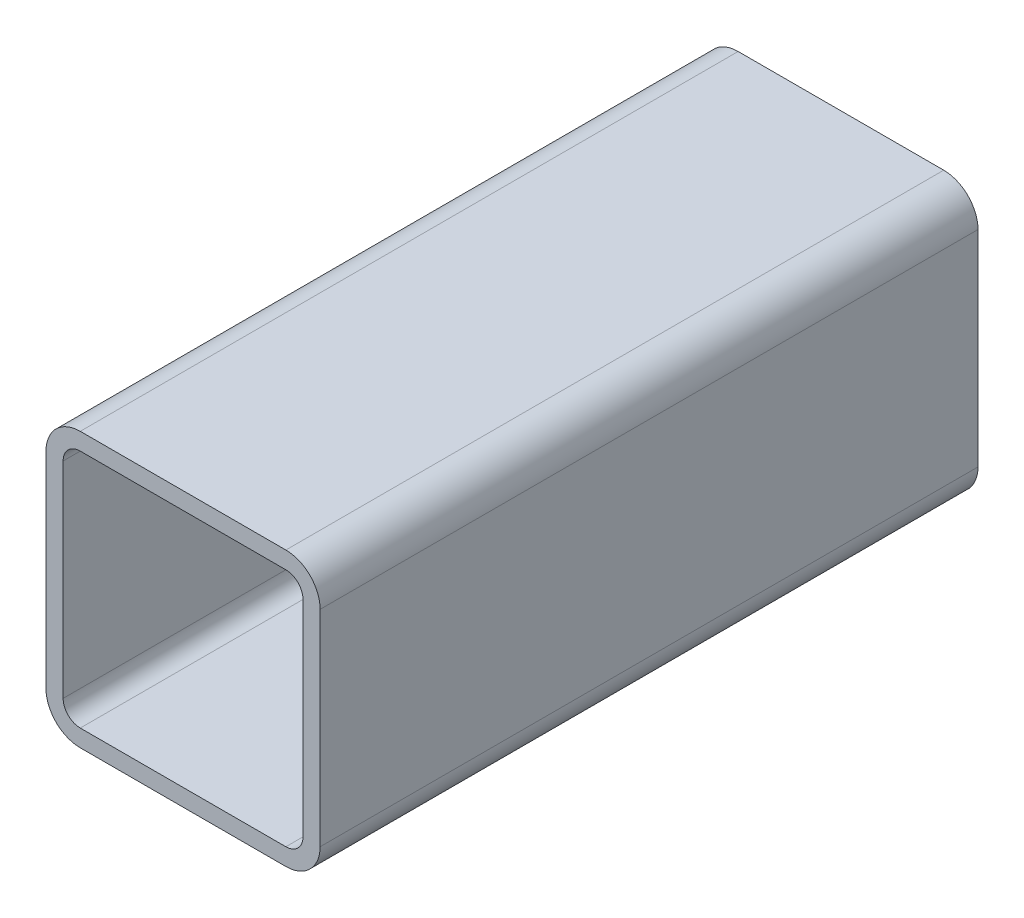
ISO-10303-21;
HEADER;
FILE_DESCRIPTION(('STEP AP214'),'2;1');
FILE_NAME('part.step','',(''),(''),'','','');
FILE_SCHEMA(('AUTOMOTIVE_DESIGN { 1 0 10303 214 1 1 1 1 }'));
ENDSEC;
DATA;
#1=APPLICATION_CONTEXT('core data for automotive mechanical design processes');
#2=APPLICATION_PROTOCOL_DEFINITION('international standard','automotive_design',2000,#1);
#3=PRODUCT_CONTEXT('',#1,'mechanical');
#4=PRODUCT('Part','Part','',(#3));
#5=PRODUCT_RELATED_PRODUCT_CATEGORY('part','',(#4));
#6=PRODUCT_DEFINITION_FORMATION('','',#4);
#7=PRODUCT_DEFINITION_CONTEXT('part definition',#1,'design');
#8=PRODUCT_DEFINITION('design','',#6,#7);
#9=PRODUCT_DEFINITION_SHAPE('','',#8);
#10=(LENGTH_UNIT() NAMED_UNIT(*) SI_UNIT(.MILLI.,.METRE.));
#11=(NAMED_UNIT(*) PLANE_ANGLE_UNIT() SI_UNIT($,.RADIAN.));
#12=(NAMED_UNIT(*) SI_UNIT($,.STERADIAN.) SOLID_ANGLE_UNIT());
#13=UNCERTAINTY_MEASURE_WITH_UNIT(LENGTH_MEASURE(1.E-05),#10,'distance_accuracy_value','');
#14=(GEOMETRIC_REPRESENTATION_CONTEXT(3) GLOBAL_UNCERTAINTY_ASSIGNED_CONTEXT((#13)) GLOBAL_UNIT_ASSIGNED_CONTEXT((#10,
#11,#12)) REPRESENTATION_CONTEXT('',''));
#15=CARTESIAN_POINT('',(0.,0.,0.));
#16=DIRECTION('',(0.,0.,1.));
#17=DIRECTION('',(1.,0.,0.));
#18=AXIS2_PLACEMENT_3D('',#15,#16,#17);
#19=CARTESIAN_POINT('',(16.7362396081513,113.15985662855,304.8));
#20=DIRECTION('',(0.,0.,1.));
#21=DIRECTION('',(1.,0.,0.));
#22=AXIS2_PLACEMENT_3D('',#19,#20,#21);
#23=PLANE('',#22);
#24=CARTESIAN_POINT('',(16.7362396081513,113.15985662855,304.8));
#25=DIRECTION('',(0.,0.,1.));
#26=DIRECTION('',(1.,0.,0.));
#27=AXIS2_PLACEMENT_3D('',#24,#25,#26);
#28=CIRCLE('',#27,15.875);
#29=CARTESIAN_POINT('',(16.7362396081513,129.03485662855,304.8));
#30=VERTEX_POINT('',#29);
#31=CARTESIAN_POINT('',(0.8612396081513,113.15985662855,304.8));
#32=VERTEX_POINT('',#31);
#33=EDGE_CURVE('E211',#30,#32,#28,.T.);
#34=ORIENTED_EDGE('',*,*,#33,.T.);
#35=DIRECTION('',(0.,-1.,0.));
#36=VECTOR('',#35,1.);
#37=CARTESIAN_POINT('',(0.8612396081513,17.90985662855,304.8));
#38=LINE('',#37,#36);
#39=CARTESIAN_POINT('',(0.8612396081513,17.90985662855,304.8));
#40=VERTEX_POINT('',#39);
#41=EDGE_CURVE('E214',#32,#40,#38,.T.);
#42=ORIENTED_EDGE('',*,*,#41,.T.);
#43=CARTESIAN_POINT('',(16.7362396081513,17.90985662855,304.8));
#44=DIRECTION('',(0.,0.,1.));
#45=DIRECTION('',(1.,0.,0.));
#46=AXIS2_PLACEMENT_3D('',#43,#44,#45);
#47=CIRCLE('',#46,15.875);
#48=CARTESIAN_POINT('',(16.7362396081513,2.03485662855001,304.8));
#49=VERTEX_POINT('',#48);
#50=EDGE_CURVE('E217',#40,#49,#47,.T.);
#51=ORIENTED_EDGE('',*,*,#50,.T.);
#52=DIRECTION('',(1.,0.,0.));
#53=VECTOR('',#52,1.);
#54=CARTESIAN_POINT('',(111.986239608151,2.03485662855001,304.8));
#55=LINE('',#54,#53);
#56=CARTESIAN_POINT('',(111.986239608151,2.03485662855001,304.8));
#57=VERTEX_POINT('',#56);
#58=EDGE_CURVE('E219',#49,#57,#55,.T.);
#59=ORIENTED_EDGE('',*,*,#58,.T.);
#60=CARTESIAN_POINT('',(111.986239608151,17.90985662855,304.8));
#61=DIRECTION('',(0.,0.,1.));
#62=DIRECTION('',(1.,0.,0.));
#63=AXIS2_PLACEMENT_3D('',#60,#61,#62);
#64=CIRCLE('',#63,15.875);
#65=CARTESIAN_POINT('',(127.861239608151,17.90985662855,304.8));
#66=VERTEX_POINT('',#65);
#67=EDGE_CURVE('E221',#57,#66,#64,.T.);
#68=ORIENTED_EDGE('',*,*,#67,.T.);
#69=DIRECTION('',(0.,1.,0.));
#70=VECTOR('',#69,1.);
#71=CARTESIAN_POINT('',(127.861239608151,113.15985662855,304.8));
#72=LINE('',#71,#70);
#73=CARTESIAN_POINT('',(127.861239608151,113.15985662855,304.8));
#74=VERTEX_POINT('',#73);
#75=EDGE_CURVE('E223',#66,#74,#72,.T.);
#76=ORIENTED_EDGE('',*,*,#75,.T.);
#77=CARTESIAN_POINT('',(111.986239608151,113.15985662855,304.8));
#78=DIRECTION('',(0.,0.,1.));
#79=DIRECTION('',(1.,0.,0.));
#80=AXIS2_PLACEMENT_3D('',#77,#78,#79);
#81=CIRCLE('',#80,15.875);
#82=CARTESIAN_POINT('',(111.986239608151,129.03485662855,304.8));
#83=VERTEX_POINT('',#82);
#84=EDGE_CURVE('E225',#74,#83,#81,.T.);
#85=ORIENTED_EDGE('',*,*,#84,.T.);
#86=DIRECTION('',(-1.,0.,0.));
#87=VECTOR('',#86,1.);
#88=CARTESIAN_POINT('',(16.7362396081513,129.03485662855,304.8));
#89=LINE('',#88,#87);
#90=EDGE_CURVE('E227',#83,#30,#89,.T.);
#91=ORIENTED_EDGE('',*,*,#90,.T.);
#92=EDGE_LOOP('',(#34,#42,#51,#59,#68,#76,#85,#91));
#93=FACE_BOUND('',#92,.T.);
#94=DIRECTION('',(0.,-1.,0.));
#95=VECTOR('',#94,1.);
#96=CARTESIAN_POINT('',(8.7987396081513,17.90985662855,304.8));
#97=LINE('',#96,#95);
#98=CARTESIAN_POINT('',(8.7987396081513,113.15985662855,304.8));
#99=VERTEX_POINT('',#98);
#100=CARTESIAN_POINT('',(8.7987396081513,17.90985662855,304.8));
#101=VERTEX_POINT('',#100);
#102=EDGE_CURVE('E154',#99,#101,#97,.T.);
#103=ORIENTED_EDGE('',*,*,#102,.F.);
#104=CARTESIAN_POINT('',(16.7362396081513,113.15985662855,304.8));
#105=DIRECTION('',(0.,0.,1.));
#106=DIRECTION('',(1.,0.,0.));
#107=AXIS2_PLACEMENT_3D('',#104,#105,#106);
#108=CIRCLE('',#107,7.9375);
#109=CARTESIAN_POINT('',(16.7362396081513,121.09735662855,304.8));
#110=VERTEX_POINT('',#109);
#111=EDGE_CURVE('E146',#110,#99,#108,.T.);
#112=ORIENTED_EDGE('',*,*,#111,.F.);
#113=DIRECTION('',(-1.,0.,0.));
#114=VECTOR('',#113,1.);
#115=CARTESIAN_POINT('',(16.7362396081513,121.09735662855,304.8));
#116=LINE('',#115,#114);
#117=CARTESIAN_POINT('',(111.986239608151,121.09735662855,304.8));
#118=VERTEX_POINT('',#117);
#119=EDGE_CURVE('E179',#118,#110,#116,.T.);
#120=ORIENTED_EDGE('',*,*,#119,.F.);
#121=CARTESIAN_POINT('',(111.986239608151,113.15985662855,304.8));
#122=DIRECTION('',(0.,0.,1.));
#123=DIRECTION('',(1.,0.,0.));
#124=AXIS2_PLACEMENT_3D('',#121,#122,#123);
#125=CIRCLE('',#124,7.9375);
#126=CARTESIAN_POINT('',(119.923739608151,113.15985662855,304.8));
#127=VERTEX_POINT('',#126);
#128=EDGE_CURVE('E177',#127,#118,#125,.T.);
#129=ORIENTED_EDGE('',*,*,#128,.F.);
#130=DIRECTION('',(0.,1.,0.));
#131=VECTOR('',#130,1.);
#132=CARTESIAN_POINT('',(119.923739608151,113.15985662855,304.8));
#133=LINE('',#132,#131);
#134=CARTESIAN_POINT('',(119.923739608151,17.90985662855,304.8));
#135=VERTEX_POINT('',#134);
#136=EDGE_CURVE('E175',#135,#127,#133,.T.);
#137=ORIENTED_EDGE('',*,*,#136,.F.);
#138=CARTESIAN_POINT('',(111.986239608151,17.90985662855,304.8));
#139=DIRECTION('',(0.,0.,1.));
#140=DIRECTION('',(1.,0.,0.));
#141=AXIS2_PLACEMENT_3D('',#138,#139,#140);
#142=CIRCLE('',#141,7.93750000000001);
#143=CARTESIAN_POINT('',(111.986239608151,9.97235662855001,304.8));
#144=VERTEX_POINT('',#143);
#145=EDGE_CURVE('E173',#144,#135,#142,.T.);
#146=ORIENTED_EDGE('',*,*,#145,.F.);
#147=DIRECTION('',(1.,0.,0.));
#148=VECTOR('',#147,1.);
#149=CARTESIAN_POINT('',(111.986239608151,9.97235662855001,304.8));
#150=LINE('',#149,#148);
#151=CARTESIAN_POINT('',(16.7362396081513,9.97235662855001,304.8));
#152=VERTEX_POINT('',#151);
#153=EDGE_CURVE('E169',#152,#144,#150,.T.);
#154=ORIENTED_EDGE('',*,*,#153,.F.);
#155=CARTESIAN_POINT('',(16.7362396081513,17.90985662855,304.8));
#156=DIRECTION('',(0.,0.,1.));
#157=DIRECTION('',(1.,0.,0.));
#158=AXIS2_PLACEMENT_3D('',#155,#156,#157);
#159=CIRCLE('',#158,7.9375);
#160=EDGE_CURVE('E167',#101,#152,#159,.T.);
#161=ORIENTED_EDGE('',*,*,#160,.F.);
#162=EDGE_LOOP('',(#103,#112,#120,#129,#137,#146,#154,#161));
#163=FACE_BOUND('',#162,.T.);
#164=ADVANCED_FACE('F33',(#93,#163),#23,.T.);
#165=CARTESIAN_POINT('',(16.7362396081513,113.15985662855,0.));
#166=DIRECTION('',(0.,0.,1.));
#167=DIRECTION('',(1.,0.,0.));
#168=AXIS2_PLACEMENT_3D('',#165,#166,#167);
#169=PLANE('',#168);
#170=CARTESIAN_POINT('',(16.7362396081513,113.15985662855,0.));
#171=DIRECTION('',(0.,0.,1.));
#172=DIRECTION('',(1.,0.,0.));
#173=AXIS2_PLACEMENT_3D('',#170,#171,#172);
#174=CIRCLE('',#173,15.875);
#175=CARTESIAN_POINT('',(16.7362396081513,129.03485662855,0.));
#176=VERTEX_POINT('',#175);
#177=CARTESIAN_POINT('',(0.8612396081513,113.15985662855,0.));
#178=VERTEX_POINT('',#177);
#179=EDGE_CURVE('E162',#176,#178,#174,.T.);
#180=ORIENTED_EDGE('',*,*,#179,.F.);
#181=DIRECTION('',(-1.,0.,0.));
#182=VECTOR('',#181,1.);
#183=CARTESIAN_POINT('',(16.7362396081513,129.03485662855,0.));
#184=LINE('',#183,#182);
#185=CARTESIAN_POINT('',(111.986239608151,129.03485662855,0.));
#186=VERTEX_POINT('',#185);
#187=EDGE_CURVE('E215',#186,#176,#184,.T.);
#188=ORIENTED_EDGE('',*,*,#187,.F.);
#189=CARTESIAN_POINT('',(111.986239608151,113.15985662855,0.));
#190=DIRECTION('',(0.,0.,1.));
#191=DIRECTION('',(1.,0.,0.));
#192=AXIS2_PLACEMENT_3D('',#189,#190,#191);
#193=CIRCLE('',#192,15.875);
#194=CARTESIAN_POINT('',(127.861239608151,113.15985662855,0.));
#195=VERTEX_POINT('',#194);
#196=EDGE_CURVE('E242',#195,#186,#193,.T.);
#197=ORIENTED_EDGE('',*,*,#196,.F.);
#198=DIRECTION('',(0.,1.,0.));
#199=VECTOR('',#198,1.);
#200=CARTESIAN_POINT('',(127.861239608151,113.15985662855,0.));
#201=LINE('',#200,#199);
#202=CARTESIAN_POINT('',(127.861239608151,17.90985662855,0.));
#203=VERTEX_POINT('',#202);
#204=EDGE_CURVE('E240',#203,#195,#201,.T.);
#205=ORIENTED_EDGE('',*,*,#204,.F.);
#206=CARTESIAN_POINT('',(111.986239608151,17.90985662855,0.));
#207=DIRECTION('',(0.,0.,1.));
#208=DIRECTION('',(1.,0.,0.));
#209=AXIS2_PLACEMENT_3D('',#206,#207,#208);
#210=CIRCLE('',#209,15.875);
#211=CARTESIAN_POINT('',(111.986239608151,2.03485662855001,0.));
#212=VERTEX_POINT('',#211);
#213=EDGE_CURVE('E238',#212,#203,#210,.T.);
#214=ORIENTED_EDGE('',*,*,#213,.F.);
#215=DIRECTION('',(1.,0.,0.));
#216=VECTOR('',#215,1.);
#217=CARTESIAN_POINT('',(111.986239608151,2.03485662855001,0.));
#218=LINE('',#217,#216);
#219=CARTESIAN_POINT('',(16.7362396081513,2.03485662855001,0.));
#220=VERTEX_POINT('',#219);
#221=EDGE_CURVE('E236',#220,#212,#218,.T.);
#222=ORIENTED_EDGE('',*,*,#221,.F.);
#223=CARTESIAN_POINT('',(16.7362396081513,17.90985662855,0.));
#224=DIRECTION('',(0.,0.,1.));
#225=DIRECTION('',(1.,0.,0.));
#226=AXIS2_PLACEMENT_3D('',#223,#224,#225);
#227=CIRCLE('',#226,15.875);
#228=CARTESIAN_POINT('',(0.8612396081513,17.90985662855,0.));
#229=VERTEX_POINT('',#228);
#230=EDGE_CURVE('E234',#229,#220,#227,.T.);
#231=ORIENTED_EDGE('',*,*,#230,.F.);
#232=DIRECTION('',(0.,-1.,0.));
#233=VECTOR('',#232,1.);
#234=CARTESIAN_POINT('',(0.8612396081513,17.90985662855,0.));
#235=LINE('',#234,#233);
#236=EDGE_CURVE('E232',#178,#229,#235,.T.);
#237=ORIENTED_EDGE('',*,*,#236,.F.);
#238=EDGE_LOOP('',(#180,#188,#197,#205,#214,#222,#231,#237));
#239=FACE_BOUND('',#238,.T.);
#240=CARTESIAN_POINT('',(16.7362396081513,113.15985662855,0.));
#241=DIRECTION('',(0.,0.,1.));
#242=DIRECTION('',(1.,0.,0.));
#243=AXIS2_PLACEMENT_3D('',#240,#241,#242);
#244=CIRCLE('',#243,7.9375);
#245=CARTESIAN_POINT('',(16.7362396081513,121.09735662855,0.));
#246=VERTEX_POINT('',#245);
#247=CARTESIAN_POINT('',(8.7987396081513,113.15985662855,0.));
#248=VERTEX_POINT('',#247);
#249=EDGE_CURVE('E56',#246,#248,#244,.T.);
#250=ORIENTED_EDGE('',*,*,#249,.T.);
#251=DIRECTION('',(0.,-1.,0.));
#252=VECTOR('',#251,1.);
#253=CARTESIAN_POINT('',(8.7987396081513,17.90985662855,0.));
#254=LINE('',#253,#252);
#255=CARTESIAN_POINT('',(8.7987396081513,17.90985662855,0.));
#256=VERTEX_POINT('',#255);
#257=EDGE_CURVE('E161',#248,#256,#254,.T.);
#258=ORIENTED_EDGE('',*,*,#257,.T.);
#259=CARTESIAN_POINT('',(16.7362396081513,17.90985662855,0.));
#260=DIRECTION('',(0.,0.,1.));
#261=DIRECTION('',(1.,0.,0.));
#262=AXIS2_PLACEMENT_3D('',#259,#260,#261);
#263=CIRCLE('',#262,7.9375);
#264=CARTESIAN_POINT('',(16.7362396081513,9.97235662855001,0.));
#265=VERTEX_POINT('',#264);
#266=EDGE_CURVE('E183',#256,#265,#263,.T.);
#267=ORIENTED_EDGE('',*,*,#266,.T.);
#268=DIRECTION('',(1.,0.,0.));
#269=VECTOR('',#268,1.);
#270=CARTESIAN_POINT('',(111.986239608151,9.97235662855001,0.));
#271=LINE('',#270,#269);
#272=CARTESIAN_POINT('',(111.986239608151,9.97235662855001,0.));
#273=VERTEX_POINT('',#272);
#274=EDGE_CURVE('E186',#265,#273,#271,.T.);
#275=ORIENTED_EDGE('',*,*,#274,.T.);
#276=CARTESIAN_POINT('',(111.986239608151,17.90985662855,0.));
#277=DIRECTION('',(0.,0.,1.));
#278=DIRECTION('',(1.,0.,0.));
#279=AXIS2_PLACEMENT_3D('',#276,#277,#278);
#280=CIRCLE('',#279,7.93750000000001);
#281=CARTESIAN_POINT('',(119.923739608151,17.90985662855,0.));
#282=VERTEX_POINT('',#281);
#283=EDGE_CURVE('E189',#273,#282,#280,.T.);
#284=ORIENTED_EDGE('',*,*,#283,.T.);
#285=DIRECTION('',(0.,1.,0.));
#286=VECTOR('',#285,1.);
#287=CARTESIAN_POINT('',(119.923739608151,113.15985662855,0.));
#288=LINE('',#287,#286);
#289=CARTESIAN_POINT('',(119.923739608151,113.15985662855,0.));
#290=VERTEX_POINT('',#289);
#291=EDGE_CURVE('E192',#282,#290,#288,.T.);
#292=ORIENTED_EDGE('',*,*,#291,.T.);
#293=CARTESIAN_POINT('',(111.986239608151,113.15985662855,0.));
#294=DIRECTION('',(0.,0.,1.));
#295=DIRECTION('',(1.,0.,0.));
#296=AXIS2_PLACEMENT_3D('',#293,#294,#295);
#297=CIRCLE('',#296,7.9375);
#298=CARTESIAN_POINT('',(111.986239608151,121.09735662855,0.));
#299=VERTEX_POINT('',#298);
#300=EDGE_CURVE('E195',#290,#299,#297,.T.);
#301=ORIENTED_EDGE('',*,*,#300,.T.);
#302=DIRECTION('',(-1.,0.,0.));
#303=VECTOR('',#302,1.);
#304=CARTESIAN_POINT('',(16.7362396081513,121.09735662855,0.));
#305=LINE('',#304,#303);
#306=EDGE_CURVE('E155',#299,#246,#305,.T.);
#307=ORIENTED_EDGE('',*,*,#306,.T.);
#308=EDGE_LOOP('',(#250,#258,#267,#275,#284,#292,#301,#307));
#309=FACE_BOUND('',#308,.T.);
#310=ADVANCED_FACE('F272',(#239,#309),#169,.F.);
#311=CARTESIAN_POINT('',(16.7362396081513,113.15985662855,304.8));
#312=DIRECTION('',(0.,0.,-1.));
#313=DIRECTION('',(-1.,0.,0.));
#314=AXIS2_PLACEMENT_3D('',#311,#312,#313);
#315=CYLINDRICAL_SURFACE('',#314,15.875);
#316=ORIENTED_EDGE('',*,*,#179,.T.);
#317=DIRECTION('',(0.,0.,-1.));
#318=VECTOR('',#317,1.);
#319=CARTESIAN_POINT('',(0.8612396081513,113.15985662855,304.8));
#320=LINE('',#319,#318);
#321=EDGE_CURVE('E11',#32,#178,#320,.T.);
#322=ORIENTED_EDGE('',*,*,#321,.F.);
#323=ORIENTED_EDGE('',*,*,#33,.F.);
#324=DIRECTION('',(0.,0.,-1.));
#325=VECTOR('',#324,1.);
#326=CARTESIAN_POINT('',(16.7362396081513,129.03485662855,304.8));
#327=LINE('',#326,#325);
#328=EDGE_CURVE('E229',#30,#176,#327,.T.);
#329=ORIENTED_EDGE('',*,*,#328,.T.);
#330=EDGE_LOOP('',(#316,#322,#323,#329));
#331=FACE_BOUND('',#330,.T.);
#332=ADVANCED_FACE('F35',(#331),#315,.T.);
#333=CARTESIAN_POINT('',(0.8612396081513,17.90985662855,304.8));
#334=DIRECTION('',(1.,0.,0.));
#335=DIRECTION('',(0.,0.,-1.));
#336=AXIS2_PLACEMENT_3D('',#333,#334,#335);
#337=PLANE('',#336);
#338=ORIENTED_EDGE('',*,*,#236,.T.);
#339=DIRECTION('',(0.,0.,-1.));
#340=VECTOR('',#339,1.);
#341=CARTESIAN_POINT('',(0.8612396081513,17.90985662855,304.8));
#342=LINE('',#341,#340);
#343=EDGE_CURVE('E41',#40,#229,#342,.T.);
#344=ORIENTED_EDGE('',*,*,#343,.F.);
#345=ORIENTED_EDGE('',*,*,#41,.F.);
#346=ORIENTED_EDGE('',*,*,#321,.T.);
#347=EDGE_LOOP('',(#338,#344,#345,#346));
#348=FACE_BOUND('',#347,.T.);
#349=ADVANCED_FACE('F289',(#348),#337,.F.);
#350=CARTESIAN_POINT('',(16.7362396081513,17.90985662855,304.8));
#351=DIRECTION('',(0.,0.,-1.));
#352=DIRECTION('',(-1.,0.,0.));
#353=AXIS2_PLACEMENT_3D('',#350,#351,#352);
#354=CYLINDRICAL_SURFACE('',#353,15.875);
#355=ORIENTED_EDGE('',*,*,#230,.T.);
#356=DIRECTION('',(0.,0.,-1.));
#357=VECTOR('',#356,1.);
#358=CARTESIAN_POINT('',(16.7362396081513,2.03485662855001,304.8));
#359=LINE('',#358,#357);
#360=EDGE_CURVE('E259',#49,#220,#359,.T.);
#361=ORIENTED_EDGE('',*,*,#360,.F.);
#362=ORIENTED_EDGE('',*,*,#50,.F.);
#363=ORIENTED_EDGE('',*,*,#343,.T.);
#364=EDGE_LOOP('',(#355,#361,#362,#363));
#365=FACE_BOUND('',#364,.T.);
#366=ADVANCED_FACE('F266',(#365),#354,.T.);
#367=CARTESIAN_POINT('',(111.986239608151,2.03485662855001,304.8));
#368=DIRECTION('',(0.,1.,0.));
#369=DIRECTION('',(0.,0.,1.));
#370=AXIS2_PLACEMENT_3D('',#367,#368,#369);
#371=PLANE('',#370);
#372=ORIENTED_EDGE('',*,*,#221,.T.);
#373=DIRECTION('',(0.,0.,-1.));
#374=VECTOR('',#373,1.);
#375=CARTESIAN_POINT('',(111.986239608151,2.03485662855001,304.8));
#376=LINE('',#375,#374);
#377=EDGE_CURVE('E256',#57,#212,#376,.T.);
#378=ORIENTED_EDGE('',*,*,#377,.F.);
#379=ORIENTED_EDGE('',*,*,#58,.F.);
#380=ORIENTED_EDGE('',*,*,#360,.T.);
#381=EDGE_LOOP('',(#372,#378,#379,#380));
#382=FACE_BOUND('',#381,.T.);
#383=ADVANCED_FACE('F278',(#382),#371,.F.);
#384=CARTESIAN_POINT('',(111.986239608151,17.90985662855,304.8));
#385=DIRECTION('',(0.,0.,-1.));
#386=DIRECTION('',(-1.,0.,0.));
#387=AXIS2_PLACEMENT_3D('',#384,#385,#386);
#388=CYLINDRICAL_SURFACE('',#387,15.875);
#389=ORIENTED_EDGE('',*,*,#213,.T.);
#390=DIRECTION('',(0.,0.,-1.));
#391=VECTOR('',#390,1.);
#392=CARTESIAN_POINT('',(127.861239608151,17.90985662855,304.8));
#393=LINE('',#392,#391);
#394=EDGE_CURVE('E253',#66,#203,#393,.T.);
#395=ORIENTED_EDGE('',*,*,#394,.F.);
#396=ORIENTED_EDGE('',*,*,#67,.F.);
#397=ORIENTED_EDGE('',*,*,#377,.T.);
#398=EDGE_LOOP('',(#389,#395,#396,#397));
#399=FACE_BOUND('',#398,.T.);
#400=ADVANCED_FACE('F282',(#399),#388,.T.);
#401=CARTESIAN_POINT('',(127.861239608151,113.15985662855,304.8));
#402=DIRECTION('',(-1.,0.,0.));
#403=DIRECTION('',(0.,0.,1.));
#404=AXIS2_PLACEMENT_3D('',#401,#402,#403);
#405=PLANE('',#404);
#406=ORIENTED_EDGE('',*,*,#204,.T.);
#407=DIRECTION('',(0.,0.,-1.));
#408=VECTOR('',#407,1.);
#409=CARTESIAN_POINT('',(127.861239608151,113.15985662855,304.8));
#410=LINE('',#409,#408);
#411=EDGE_CURVE('E250',#74,#195,#410,.T.);
#412=ORIENTED_EDGE('',*,*,#411,.F.);
#413=ORIENTED_EDGE('',*,*,#75,.F.);
#414=ORIENTED_EDGE('',*,*,#394,.T.);
#415=EDGE_LOOP('',(#406,#412,#413,#414));
#416=FACE_BOUND('',#415,.T.);
#417=ADVANCED_FACE('F302',(#416),#405,.F.);
#418=CARTESIAN_POINT('',(111.986239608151,113.15985662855,304.8));
#419=DIRECTION('',(0.,0.,-1.));
#420=DIRECTION('',(-1.,0.,0.));
#421=AXIS2_PLACEMENT_3D('',#418,#419,#420);
#422=CYLINDRICAL_SURFACE('',#421,15.875);
#423=ORIENTED_EDGE('',*,*,#196,.T.);
#424=DIRECTION('',(0.,0.,-1.));
#425=VECTOR('',#424,1.);
#426=CARTESIAN_POINT('',(111.986239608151,129.03485662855,304.8));
#427=LINE('',#426,#425);
#428=EDGE_CURVE('E247',#83,#186,#427,.T.);
#429=ORIENTED_EDGE('',*,*,#428,.F.);
#430=ORIENTED_EDGE('',*,*,#84,.F.);
#431=ORIENTED_EDGE('',*,*,#411,.T.);
#432=EDGE_LOOP('',(#423,#429,#430,#431));
#433=FACE_BOUND('',#432,.T.);
#434=ADVANCED_FACE('F300',(#433),#422,.T.);
#435=CARTESIAN_POINT('',(16.7362396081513,129.03485662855,304.8));
#436=DIRECTION('',(0.,-1.,0.));
#437=DIRECTION('',(0.,0.,-1.));
#438=AXIS2_PLACEMENT_3D('',#435,#436,#437);
#439=PLANE('',#438);
#440=ORIENTED_EDGE('',*,*,#187,.T.);
#441=ORIENTED_EDGE('',*,*,#328,.F.);
#442=ORIENTED_EDGE('',*,*,#90,.F.);
#443=ORIENTED_EDGE('',*,*,#428,.T.);
#444=EDGE_LOOP('',(#440,#441,#442,#443));
#445=FACE_BOUND('',#444,.T.);
#446=ADVANCED_FACE('F295',(#445),#439,.F.);
#447=CARTESIAN_POINT('',(16.7362396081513,113.15985662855,304.8));
#448=DIRECTION('',(0.,0.,-1.));
#449=DIRECTION('',(-1.,0.,0.));
#450=AXIS2_PLACEMENT_3D('',#447,#448,#449);
#451=CYLINDRICAL_SURFACE('',#450,7.9375);
#452=ORIENTED_EDGE('',*,*,#249,.F.);
#453=DIRECTION('',(0.,0.,-1.));
#454=VECTOR('',#453,1.);
#455=CARTESIAN_POINT('',(16.7362396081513,121.09735662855,304.8));
#456=LINE('',#455,#454);
#457=EDGE_CURVE('E150',#110,#246,#456,.T.);
#458=ORIENTED_EDGE('',*,*,#457,.F.);
#459=ORIENTED_EDGE('',*,*,#111,.T.);
#460=DIRECTION('',(0.,0.,-1.));
#461=VECTOR('',#460,1.);
#462=CARTESIAN_POINT('',(8.7987396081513,113.15985662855,304.8));
#463=LINE('',#462,#461);
#464=EDGE_CURVE('E149',#99,#248,#463,.T.);
#465=ORIENTED_EDGE('',*,*,#464,.T.);
#466=EDGE_LOOP('',(#452,#458,#459,#465));
#467=FACE_BOUND('',#466,.T.);
#468=ADVANCED_FACE('F148',(#467),#451,.F.);
#469=CARTESIAN_POINT('',(8.7987396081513,17.90985662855,304.8));
#470=DIRECTION('',(1.,0.,0.));
#471=DIRECTION('',(0.,0.,-1.));
#472=AXIS2_PLACEMENT_3D('',#469,#470,#471);
#473=PLANE('',#472);
#474=ORIENTED_EDGE('',*,*,#257,.F.);
#475=ORIENTED_EDGE('',*,*,#464,.F.);
#476=ORIENTED_EDGE('',*,*,#102,.T.);
#477=DIRECTION('',(0.,0.,-1.));
#478=VECTOR('',#477,1.);
#479=CARTESIAN_POINT('',(8.7987396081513,17.90985662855,304.8));
#480=LINE('',#479,#478);
#481=EDGE_CURVE('E163',#101,#256,#480,.T.);
#482=ORIENTED_EDGE('',*,*,#481,.T.);
#483=EDGE_LOOP('',(#474,#475,#476,#482));
#484=FACE_BOUND('',#483,.T.);
#485=ADVANCED_FACE('F158',(#484),#473,.T.);
#486=CARTESIAN_POINT('',(16.7362396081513,17.90985662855,304.8));
#487=DIRECTION('',(0.,0.,-1.));
#488=DIRECTION('',(-1.,0.,0.));
#489=AXIS2_PLACEMENT_3D('',#486,#487,#488);
#490=CYLINDRICAL_SURFACE('',#489,7.9375);
#491=ORIENTED_EDGE('',*,*,#266,.F.);
#492=ORIENTED_EDGE('',*,*,#481,.F.);
#493=ORIENTED_EDGE('',*,*,#160,.T.);
#494=DIRECTION('',(0.,0.,-1.));
#495=VECTOR('',#494,1.);
#496=CARTESIAN_POINT('',(16.7362396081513,9.97235662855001,304.8));
#497=LINE('',#496,#495);
#498=EDGE_CURVE('E208',#152,#265,#497,.T.);
#499=ORIENTED_EDGE('',*,*,#498,.T.);
#500=EDGE_LOOP('',(#491,#492,#493,#499));
#501=FACE_BOUND('',#500,.T.);
#502=ADVANCED_FACE('F327',(#501),#490,.F.);
#503=CARTESIAN_POINT('',(111.986239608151,9.97235662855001,304.8));
#504=DIRECTION('',(0.,1.,0.));
#505=DIRECTION('',(0.,0.,1.));
#506=AXIS2_PLACEMENT_3D('',#503,#504,#505);
#507=PLANE('',#506);
#508=ORIENTED_EDGE('',*,*,#274,.F.);
#509=ORIENTED_EDGE('',*,*,#498,.F.);
#510=ORIENTED_EDGE('',*,*,#153,.T.);
#511=DIRECTION('',(0.,0.,-1.));
#512=VECTOR('',#511,1.);
#513=CARTESIAN_POINT('',(111.986239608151,9.97235662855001,304.8));
#514=LINE('',#513,#512);
#515=EDGE_CURVE('E206',#144,#273,#514,.T.);
#516=ORIENTED_EDGE('',*,*,#515,.T.);
#517=EDGE_LOOP('',(#508,#509,#510,#516));
#518=FACE_BOUND('',#517,.T.);
#519=ADVANCED_FACE('F331',(#518),#507,.T.);
#520=CARTESIAN_POINT('',(111.986239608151,17.90985662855,304.8));
#521=DIRECTION('',(0.,0.,-1.));
#522=DIRECTION('',(-1.,0.,0.));
#523=AXIS2_PLACEMENT_3D('',#520,#521,#522);
#524=CYLINDRICAL_SURFACE('',#523,7.93750000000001);
#525=ORIENTED_EDGE('',*,*,#283,.F.);
#526=ORIENTED_EDGE('',*,*,#515,.F.);
#527=ORIENTED_EDGE('',*,*,#145,.T.);
#528=DIRECTION('',(0.,0.,-1.));
#529=VECTOR('',#528,1.);
#530=CARTESIAN_POINT('',(119.923739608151,17.90985662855,304.8));
#531=LINE('',#530,#529);
#532=EDGE_CURVE('E204',#135,#282,#531,.T.);
#533=ORIENTED_EDGE('',*,*,#532,.T.);
#534=EDGE_LOOP('',(#525,#526,#527,#533));
#535=FACE_BOUND('',#534,.T.);
#536=ADVANCED_FACE('F337',(#535),#524,.F.);
#537=CARTESIAN_POINT('',(119.923739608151,113.15985662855,304.8));
#538=DIRECTION('',(-1.,0.,0.));
#539=DIRECTION('',(0.,0.,1.));
#540=AXIS2_PLACEMENT_3D('',#537,#538,#539);
#541=PLANE('',#540);
#542=ORIENTED_EDGE('',*,*,#291,.F.);
#543=ORIENTED_EDGE('',*,*,#532,.F.);
#544=ORIENTED_EDGE('',*,*,#136,.T.);
#545=DIRECTION('',(0.,0.,-1.));
#546=VECTOR('',#545,1.);
#547=CARTESIAN_POINT('',(119.923739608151,113.15985662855,304.8));
#548=LINE('',#547,#546);
#549=EDGE_CURVE('E202',#127,#290,#548,.T.);
#550=ORIENTED_EDGE('',*,*,#549,.T.);
#551=EDGE_LOOP('',(#542,#543,#544,#550));
#552=FACE_BOUND('',#551,.T.);
#553=ADVANCED_FACE('F341',(#552),#541,.T.);
#554=CARTESIAN_POINT('',(111.986239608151,113.15985662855,304.8));
#555=DIRECTION('',(0.,0.,-1.));
#556=DIRECTION('',(-1.,0.,0.));
#557=AXIS2_PLACEMENT_3D('',#554,#555,#556);
#558=CYLINDRICAL_SURFACE('',#557,7.9375);
#559=ORIENTED_EDGE('',*,*,#300,.F.);
#560=ORIENTED_EDGE('',*,*,#549,.F.);
#561=ORIENTED_EDGE('',*,*,#128,.T.);
#562=DIRECTION('',(0.,0.,-1.));
#563=VECTOR('',#562,1.);
#564=CARTESIAN_POINT('',(111.986239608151,121.09735662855,304.8));
#565=LINE('',#564,#563);
#566=EDGE_CURVE('E48',#118,#299,#565,.T.);
#567=ORIENTED_EDGE('',*,*,#566,.T.);
#568=EDGE_LOOP('',(#559,#560,#561,#567));
#569=FACE_BOUND('',#568,.T.);
#570=ADVANCED_FACE('F345',(#569),#558,.F.);
#571=CARTESIAN_POINT('',(16.7362396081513,121.09735662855,304.8));
#572=DIRECTION('',(0.,-1.,0.));
#573=DIRECTION('',(0.,0.,-1.));
#574=AXIS2_PLACEMENT_3D('',#571,#572,#573);
#575=PLANE('',#574);
#576=ORIENTED_EDGE('',*,*,#306,.F.);
#577=ORIENTED_EDGE('',*,*,#566,.F.);
#578=ORIENTED_EDGE('',*,*,#119,.T.);
#579=ORIENTED_EDGE('',*,*,#457,.T.);
#580=EDGE_LOOP('',(#576,#577,#578,#579));
#581=FACE_BOUND('',#580,.T.);
#582=ADVANCED_FACE('F349',(#581),#575,.T.);
#583=CLOSED_SHELL('',(#164,#310,#332,#349,#366,#383,#400,#417,#434,#446,#468,#485,#502,#519,
#536,#553,#570,#582));
#584=MANIFOLD_SOLID_BREP('B2',#583);
#585=ADVANCED_BREP_SHAPE_REPRESENTATION('',(#18,#584),#14);
#586=SHAPE_DEFINITION_REPRESENTATION(#9,#585);
ENDSEC;
END-ISO-10303-21;
